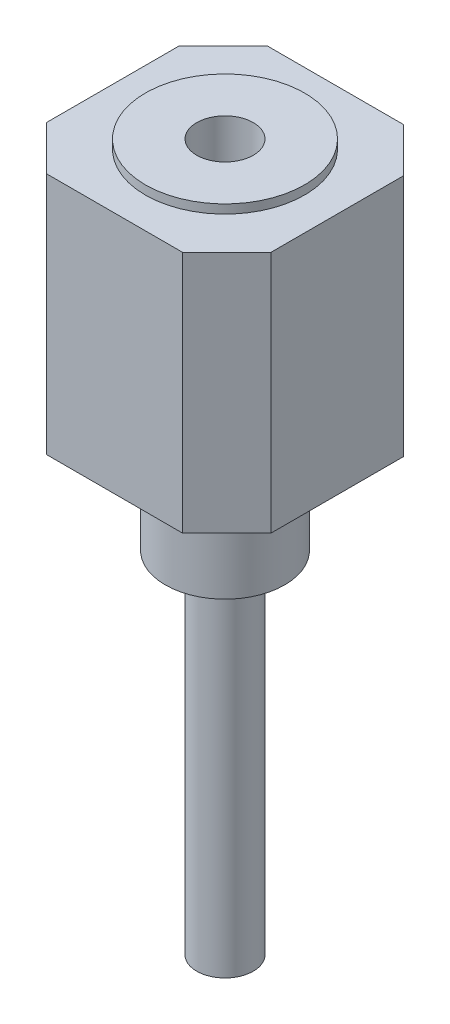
ISO-10303-21;
HEADER;
FILE_DESCRIPTION(('STEP AP214'),'2;1');
FILE_NAME('part.step','',(''),(''),'','','');
FILE_SCHEMA(('AUTOMOTIVE_DESIGN { 1 0 10303 214 1 1 1 1 }'));
ENDSEC;
DATA;
#1=APPLICATION_CONTEXT('core data for automotive mechanical design processes');
#2=APPLICATION_PROTOCOL_DEFINITION('international standard','automotive_design',2000,#1);
#3=PRODUCT_CONTEXT('',#1,'mechanical');
#4=PRODUCT('Part','Part','',(#3));
#5=PRODUCT_RELATED_PRODUCT_CATEGORY('part','',(#4));
#6=PRODUCT_DEFINITION_FORMATION('','',#4);
#7=PRODUCT_DEFINITION_CONTEXT('part definition',#1,'design');
#8=PRODUCT_DEFINITION('design','',#6,#7);
#9=PRODUCT_DEFINITION_SHAPE('','',#8);
#10=(LENGTH_UNIT() NAMED_UNIT(*) SI_UNIT(.MILLI.,.METRE.));
#11=(NAMED_UNIT(*) PLANE_ANGLE_UNIT() SI_UNIT($,.RADIAN.));
#12=(NAMED_UNIT(*) SI_UNIT($,.STERADIAN.) SOLID_ANGLE_UNIT());
#13=UNCERTAINTY_MEASURE_WITH_UNIT(LENGTH_MEASURE(1.E-05),#10,'distance_accuracy_value','');
#14=(GEOMETRIC_REPRESENTATION_CONTEXT(3) GLOBAL_UNCERTAINTY_ASSIGNED_CONTEXT((#13)) GLOBAL_UNIT_ASSIGNED_CONTEXT((#10,
#11,#12)) REPRESENTATION_CONTEXT('',''));
#15=CARTESIAN_POINT('',(0.,0.,0.));
#16=DIRECTION('',(0.,0.,1.));
#17=DIRECTION('',(1.,0.,0.));
#18=AXIS2_PLACEMENT_3D('',#15,#16,#17);
#19=CARTESIAN_POINT('',(0.,-1.18,0.));
#20=DIRECTION('',(0.,-1.,0.));
#21=DIRECTION('',(0.,0.,-1.));
#22=AXIS2_PLACEMENT_3D('',#19,#20,#21);
#23=PLANE('',#22);
#24=CARTESIAN_POINT('',(0.,-1.18,0.));
#25=DIRECTION('',(0.,-1.,0.));
#26=DIRECTION('',(0.,0.,-1.));
#27=AXIS2_PLACEMENT_3D('',#24,#25,#26);
#28=CIRCLE('',#27,0.675);
#29=CARTESIAN_POINT('',(0.,-1.18,-0.675));
#30=VERTEX_POINT('',#29);
#31=EDGE_CURVE('E188',#30,#30,#28,.T.);
#32=ORIENTED_EDGE('',*,*,#31,.T.);
#33=EDGE_LOOP('',(#32));
#34=FACE_BOUND('',#33,.T.);
#35=CARTESIAN_POINT('',(0.,-1.18,0.));
#36=DIRECTION('',(0.,-1.,0.));
#37=DIRECTION('',(0.,0.,-1.));
#38=AXIS2_PLACEMENT_3D('',#35,#36,#37);
#39=CIRCLE('',#38,0.32);
#40=CARTESIAN_POINT('',(0.,-1.18,-0.32));
#41=VERTEX_POINT('',#40);
#42=EDGE_CURVE('E194',#41,#41,#39,.T.);
#43=ORIENTED_EDGE('',*,*,#42,.F.);
#44=EDGE_LOOP('',(#43));
#45=FACE_BOUND('',#44,.T.);
#46=ADVANCED_FACE('F33',(#34,#45),#23,.T.);
#47=CARTESIAN_POINT('',(-1.27000000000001,0.,1.25));
#48=DIRECTION('',(0.,1.,0.));
#49=DIRECTION('',(0.,0.,1.));
#50=AXIS2_PLACEMENT_3D('',#47,#48,#49);
#51=PLANE('',#50);
#52=DIRECTION('',(0.,0.,1.));
#53=VECTOR('',#52,1.);
#54=CARTESIAN_POINT('',(-1.27,0.,-0.75));
#55=LINE('',#54,#53);
#56=CARTESIAN_POINT('',(-1.27,0.,-0.75));
#57=VERTEX_POINT('',#56);
#58=CARTESIAN_POINT('',(-1.27000000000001,0.,0.75));
#59=VERTEX_POINT('',#58);
#60=EDGE_CURVE('E132',#57,#59,#55,.T.);
#61=ORIENTED_EDGE('',*,*,#60,.F.);
#62=DIRECTION('',(-0.707106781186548,0.,0.707106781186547));
#63=VECTOR('',#62,1.);
#64=CARTESIAN_POINT('',(-1.27,0.,-0.75));
#65=LINE('',#64,#63);
#66=CARTESIAN_POINT('',(-0.77,0.,-1.25));
#67=VERTEX_POINT('',#66);
#68=EDGE_CURVE('E85',#67,#57,#65,.T.);
#69=ORIENTED_EDGE('',*,*,#68,.F.);
#70=DIRECTION('',(-1.,0.,0.));
#71=VECTOR('',#70,1.);
#72=CARTESIAN_POINT('',(-0.77,0.,-1.25));
#73=LINE('',#72,#71);
#74=CARTESIAN_POINT('',(0.77,0.,-1.24999999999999));
#75=VERTEX_POINT('',#74);
#76=EDGE_CURVE('E79',#75,#67,#73,.T.);
#77=ORIENTED_EDGE('',*,*,#76,.F.);
#78=DIRECTION('',(-0.707106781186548,0.,-0.707106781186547));
#79=VECTOR('',#78,1.);
#80=CARTESIAN_POINT('',(1.27,0.,-0.749999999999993));
#81=LINE('',#80,#79);
#82=CARTESIAN_POINT('',(1.27,0.,-0.749999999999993));
#83=VERTEX_POINT('',#82);
#84=EDGE_CURVE('E122',#83,#75,#81,.T.);
#85=ORIENTED_EDGE('',*,*,#84,.F.);
#86=DIRECTION('',(0.,0.,-1.));
#87=VECTOR('',#86,1.);
#88=CARTESIAN_POINT('',(1.26999999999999,0.,0.749999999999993));
#89=LINE('',#88,#87);
#90=CARTESIAN_POINT('',(1.26999999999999,0.,0.749999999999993));
#91=VERTEX_POINT('',#90);
#92=EDGE_CURVE('E142',#91,#83,#89,.T.);
#93=ORIENTED_EDGE('',*,*,#92,.F.);
#94=DIRECTION('',(0.707106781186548,0.,-0.707106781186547));
#95=VECTOR('',#94,1.);
#96=CARTESIAN_POINT('',(1.26999999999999,0.,0.749999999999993));
#97=LINE('',#96,#95);
#98=CARTESIAN_POINT('',(0.769999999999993,0.,1.24999999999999));
#99=VERTEX_POINT('',#98);
#100=EDGE_CURVE('E140',#99,#91,#97,.T.);
#101=ORIENTED_EDGE('',*,*,#100,.F.);
#102=DIRECTION('',(1.,0.,0.));
#103=VECTOR('',#102,1.);
#104=CARTESIAN_POINT('',(-0.770000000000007,0.,1.25));
#105=LINE('',#104,#103);
#106=CARTESIAN_POINT('',(-0.770000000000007,0.,1.25));
#107=VERTEX_POINT('',#106);
#108=EDGE_CURVE('E138',#107,#99,#105,.T.);
#109=ORIENTED_EDGE('',*,*,#108,.F.);
#110=DIRECTION('',(0.707106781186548,0.,0.707106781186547));
#111=VECTOR('',#110,1.);
#112=CARTESIAN_POINT('',(-1.27000000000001,0.,0.75));
#113=LINE('',#112,#111);
#114=EDGE_CURVE('E135',#59,#107,#113,.T.);
#115=ORIENTED_EDGE('',*,*,#114,.F.);
#116=EDGE_LOOP('',(#61,#69,#77,#85,#93,#101,#109,#115));
#117=FACE_BOUND('',#116,.T.);
#118=CARTESIAN_POINT('',(0.,0.,0.));
#119=DIRECTION('',(0.,1.,0.));
#120=DIRECTION('',(0.,0.,1.));
#121=AXIS2_PLACEMENT_3D('',#118,#119,#120);
#122=CIRCLE('',#121,0.675);
#123=CARTESIAN_POINT('',(0.,0.,0.675));
#124=VERTEX_POINT('',#123);
#125=EDGE_CURVE('E11',#124,#124,#122,.F.);
#126=ORIENTED_EDGE('',*,*,#125,.F.);
#127=EDGE_LOOP('',(#126));
#128=FACE_BOUND('',#127,.T.);
#129=ADVANCED_FACE('F165',(#117,#128),#51,.F.);
#130=CARTESIAN_POINT('',(-1.27000000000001,2.75,1.25));
#131=DIRECTION('',(0.,1.,0.));
#132=DIRECTION('',(0.,0.,1.));
#133=AXIS2_PLACEMENT_3D('',#130,#131,#132);
#134=PLANE('',#133);
#135=DIRECTION('',(0.,0.,1.));
#136=VECTOR('',#135,1.);
#137=CARTESIAN_POINT('',(-1.27,2.75,-0.75));
#138=LINE('',#137,#136);
#139=CARTESIAN_POINT('',(-1.27,2.75,-0.75));
#140=VERTEX_POINT('',#139);
#141=CARTESIAN_POINT('',(-1.27000000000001,2.75,0.75));
#142=VERTEX_POINT('',#141);
#143=EDGE_CURVE('E147',#140,#142,#138,.T.);
#144=ORIENTED_EDGE('',*,*,#143,.T.);
#145=DIRECTION('',(0.707106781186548,0.,0.707106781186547));
#146=VECTOR('',#145,1.);
#147=CARTESIAN_POINT('',(-1.27000000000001,2.75,0.75));
#148=LINE('',#147,#146);
#149=CARTESIAN_POINT('',(-0.770000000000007,2.75,1.25));
#150=VERTEX_POINT('',#149);
#151=EDGE_CURVE('E94',#142,#150,#148,.T.);
#152=ORIENTED_EDGE('',*,*,#151,.T.);
#153=DIRECTION('',(1.,0.,0.));
#154=VECTOR('',#153,1.);
#155=CARTESIAN_POINT('',(-0.770000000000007,2.75,1.25));
#156=LINE('',#155,#154);
#157=CARTESIAN_POINT('',(0.769999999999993,2.75,1.24999999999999));
#158=VERTEX_POINT('',#157);
#159=EDGE_CURVE('E179',#150,#158,#156,.T.);
#160=ORIENTED_EDGE('',*,*,#159,.T.);
#161=DIRECTION('',(0.707106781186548,0.,-0.707106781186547));
#162=VECTOR('',#161,1.);
#163=CARTESIAN_POINT('',(1.26999999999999,2.75,0.749999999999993));
#164=LINE('',#163,#162);
#165=CARTESIAN_POINT('',(1.26999999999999,2.75,0.749999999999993));
#166=VERTEX_POINT('',#165);
#167=EDGE_CURVE('E178',#158,#166,#164,.T.);
#168=ORIENTED_EDGE('',*,*,#167,.T.);
#169=DIRECTION('',(0.,0.,-1.));
#170=VECTOR('',#169,1.);
#171=CARTESIAN_POINT('',(1.26999999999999,2.75,0.749999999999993));
#172=LINE('',#171,#170);
#173=CARTESIAN_POINT('',(1.27,2.75,-0.749999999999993));
#174=VERTEX_POINT('',#173);
#175=EDGE_CURVE('E114',#166,#174,#172,.T.);
#176=ORIENTED_EDGE('',*,*,#175,.T.);
#177=DIRECTION('',(-0.707106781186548,0.,-0.707106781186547));
#178=VECTOR('',#177,1.);
#179=CARTESIAN_POINT('',(1.27,2.75,-0.749999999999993));
#180=LINE('',#179,#178);
#181=CARTESIAN_POINT('',(0.77,2.75,-1.24999999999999));
#182=VERTEX_POINT('',#181);
#183=EDGE_CURVE('E107',#174,#182,#180,.T.);
#184=ORIENTED_EDGE('',*,*,#183,.T.);
#185=DIRECTION('',(-1.,0.,0.));
#186=VECTOR('',#185,1.);
#187=CARTESIAN_POINT('',(-0.77,2.75,-1.25));
#188=LINE('',#187,#186);
#189=CARTESIAN_POINT('',(-0.77,2.75,-1.25));
#190=VERTEX_POINT('',#189);
#191=EDGE_CURVE('E112',#182,#190,#188,.T.);
#192=ORIENTED_EDGE('',*,*,#191,.T.);
#193=DIRECTION('',(-0.707106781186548,0.,0.707106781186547));
#194=VECTOR('',#193,1.);
#195=CARTESIAN_POINT('',(-1.27,2.75,-0.75));
#196=LINE('',#195,#194);
#197=EDGE_CURVE('E50',#190,#140,#196,.T.);
#198=ORIENTED_EDGE('',*,*,#197,.T.);
#199=EDGE_LOOP('',(#144,#152,#160,#168,#176,#184,#192,#198));
#200=FACE_BOUND('',#199,.T.);
#201=CARTESIAN_POINT('',(0.,2.75,0.));
#202=DIRECTION('',(0.,1.,0.));
#203=DIRECTION('',(0.,0.,1.));
#204=AXIS2_PLACEMENT_3D('',#201,#202,#203);
#205=CIRCLE('',#204,0.9);
#206=CARTESIAN_POINT('',(0.,2.75,0.9));
#207=VERTEX_POINT('',#206);
#208=EDGE_CURVE('E185',#207,#207,#205,.T.);
#209=ORIENTED_EDGE('',*,*,#208,.F.);
#210=EDGE_LOOP('',(#209));
#211=FACE_BOUND('',#210,.T.);
#212=ADVANCED_FACE('F109',(#200,#211),#134,.T.);
#213=CARTESIAN_POINT('',(-1.27,2.75,-0.75));
#214=DIRECTION('',(1.,0.,0.));
#215=DIRECTION('',(0.,0.,-1.));
#216=AXIS2_PLACEMENT_3D('',#213,#214,#215);
#217=PLANE('',#216);
#218=ORIENTED_EDGE('',*,*,#60,.T.);
#219=DIRECTION('',(0.,-1.,0.));
#220=VECTOR('',#219,1.);
#221=CARTESIAN_POINT('',(-1.27000000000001,2.75,0.75));
#222=LINE('',#221,#220);
#223=EDGE_CURVE('E42',#142,#59,#222,.T.);
#224=ORIENTED_EDGE('',*,*,#223,.F.);
#225=ORIENTED_EDGE('',*,*,#143,.F.);
#226=DIRECTION('',(0.,-1.,0.));
#227=VECTOR('',#226,1.);
#228=CARTESIAN_POINT('',(-1.27,2.75,-0.75));
#229=LINE('',#228,#227);
#230=EDGE_CURVE('E128',#140,#57,#229,.T.);
#231=ORIENTED_EDGE('',*,*,#230,.T.);
#232=EDGE_LOOP('',(#218,#224,#225,#231));
#233=FACE_BOUND('',#232,.T.);
#234=ADVANCED_FACE('F35',(#233),#217,.F.);
#235=CARTESIAN_POINT('',(-1.27000000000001,2.75,0.75));
#236=DIRECTION('',(0.707106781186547,0.,-0.707106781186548));
#237=DIRECTION('',(-0.707106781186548,0.,-0.707106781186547));
#238=AXIS2_PLACEMENT_3D('',#235,#236,#237);
#239=PLANE('',#238);
#240=ORIENTED_EDGE('',*,*,#114,.T.);
#241=DIRECTION('',(0.,-1.,0.));
#242=VECTOR('',#241,1.);
#243=CARTESIAN_POINT('',(-0.770000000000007,2.75,1.25));
#244=LINE('',#243,#242);
#245=EDGE_CURVE('E157',#150,#107,#244,.T.);
#246=ORIENTED_EDGE('',*,*,#245,.F.);
#247=ORIENTED_EDGE('',*,*,#151,.F.);
#248=ORIENTED_EDGE('',*,*,#223,.T.);
#249=EDGE_LOOP('',(#240,#246,#247,#248));
#250=FACE_BOUND('',#249,.T.);
#251=ADVANCED_FACE('F160',(#250),#239,.F.);
#252=CARTESIAN_POINT('',(-0.770000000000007,2.75,1.25));
#253=DIRECTION('',(0.,0.,-1.));
#254=DIRECTION('',(-1.,0.,0.));
#255=AXIS2_PLACEMENT_3D('',#252,#253,#254);
#256=PLANE('',#255);
#257=ORIENTED_EDGE('',*,*,#108,.T.);
#258=DIRECTION('',(0.,-1.,0.));
#259=VECTOR('',#258,1.);
#260=CARTESIAN_POINT('',(0.769999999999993,2.75,1.24999999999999));
#261=LINE('',#260,#259);
#262=EDGE_CURVE('E154',#158,#99,#261,.T.);
#263=ORIENTED_EDGE('',*,*,#262,.F.);
#264=ORIENTED_EDGE('',*,*,#159,.F.);
#265=ORIENTED_EDGE('',*,*,#245,.T.);
#266=EDGE_LOOP('',(#257,#263,#264,#265));
#267=FACE_BOUND('',#266,.T.);
#268=ADVANCED_FACE('F172',(#267),#256,.F.);
#269=CARTESIAN_POINT('',(1.26999999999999,2.75,0.749999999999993));
#270=DIRECTION('',(-0.707106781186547,0.,-0.707106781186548));
#271=DIRECTION('',(-0.707106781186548,0.,0.707106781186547));
#272=AXIS2_PLACEMENT_3D('',#269,#270,#271);
#273=PLANE('',#272);
#274=ORIENTED_EDGE('',*,*,#100,.T.);
#275=DIRECTION('',(0.,-1.,0.));
#276=VECTOR('',#275,1.);
#277=CARTESIAN_POINT('',(1.26999999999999,2.75,0.749999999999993));
#278=LINE('',#277,#276);
#279=EDGE_CURVE('E151',#166,#91,#278,.T.);
#280=ORIENTED_EDGE('',*,*,#279,.F.);
#281=ORIENTED_EDGE('',*,*,#167,.F.);
#282=ORIENTED_EDGE('',*,*,#262,.T.);
#283=EDGE_LOOP('',(#274,#280,#281,#282));
#284=FACE_BOUND('',#283,.T.);
#285=ADVANCED_FACE('F176',(#284),#273,.F.);
#286=CARTESIAN_POINT('',(1.26999999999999,2.75,0.749999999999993));
#287=DIRECTION('',(-1.,0.,0.));
#288=DIRECTION('',(0.,0.,1.));
#289=AXIS2_PLACEMENT_3D('',#286,#287,#288);
#290=PLANE('',#289);
#291=ORIENTED_EDGE('',*,*,#92,.T.);
#292=DIRECTION('',(0.,-1.,0.));
#293=VECTOR('',#292,1.);
#294=CARTESIAN_POINT('',(1.27,2.75,-0.749999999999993));
#295=LINE('',#294,#293);
#296=EDGE_CURVE('E123',#174,#83,#295,.T.);
#297=ORIENTED_EDGE('',*,*,#296,.F.);
#298=ORIENTED_EDGE('',*,*,#175,.F.);
#299=ORIENTED_EDGE('',*,*,#279,.T.);
#300=EDGE_LOOP('',(#291,#297,#298,#299));
#301=FACE_BOUND('',#300,.T.);
#302=ADVANCED_FACE('F334',(#301),#290,.F.);
#303=CARTESIAN_POINT('',(1.27,2.75,-0.749999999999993));
#304=DIRECTION('',(-0.707106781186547,0.,0.707106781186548));
#305=DIRECTION('',(0.707106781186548,0.,0.707106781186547));
#306=AXIS2_PLACEMENT_3D('',#303,#304,#305);
#307=PLANE('',#306);
#308=ORIENTED_EDGE('',*,*,#84,.T.);
#309=DIRECTION('',(0.,-1.,0.));
#310=VECTOR('',#309,1.);
#311=CARTESIAN_POINT('',(0.77,2.75,-1.24999999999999));
#312=LINE('',#311,#310);
#313=EDGE_CURVE('E119',#182,#75,#312,.T.);
#314=ORIENTED_EDGE('',*,*,#313,.F.);
#315=ORIENTED_EDGE('',*,*,#183,.F.);
#316=ORIENTED_EDGE('',*,*,#296,.T.);
#317=EDGE_LOOP('',(#308,#314,#315,#316));
#318=FACE_BOUND('',#317,.T.);
#319=ADVANCED_FACE('F120',(#318),#307,.F.);
#320=CARTESIAN_POINT('',(-0.77,2.75,-1.25));
#321=DIRECTION('',(0.,0.,1.));
#322=DIRECTION('',(1.,0.,0.));
#323=AXIS2_PLACEMENT_3D('',#320,#321,#322);
#324=PLANE('',#323);
#325=ORIENTED_EDGE('',*,*,#76,.T.);
#326=DIRECTION('',(0.,-1.,0.));
#327=VECTOR('',#326,1.);
#328=CARTESIAN_POINT('',(-0.77,2.75,-1.25));
#329=LINE('',#328,#327);
#330=EDGE_CURVE('E124',#190,#67,#329,.T.);
#331=ORIENTED_EDGE('',*,*,#330,.F.);
#332=ORIENTED_EDGE('',*,*,#191,.F.);
#333=ORIENTED_EDGE('',*,*,#313,.T.);
#334=EDGE_LOOP('',(#325,#331,#332,#333));
#335=FACE_BOUND('',#334,.T.);
#336=ADVANCED_FACE('F126',(#335),#324,.F.);
#337=CARTESIAN_POINT('',(-1.27,2.75,-0.75));
#338=DIRECTION('',(0.707106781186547,0.,0.707106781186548));
#339=DIRECTION('',(0.707106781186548,0.,-0.707106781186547));
#340=AXIS2_PLACEMENT_3D('',#337,#338,#339);
#341=PLANE('',#340);
#342=ORIENTED_EDGE('',*,*,#68,.T.);
#343=ORIENTED_EDGE('',*,*,#230,.F.);
#344=ORIENTED_EDGE('',*,*,#197,.F.);
#345=ORIENTED_EDGE('',*,*,#330,.T.);
#346=EDGE_LOOP('',(#342,#343,#344,#345));
#347=FACE_BOUND('',#346,.T.);
#348=ADVANCED_FACE('F225',(#347),#341,.F.);
#349=CARTESIAN_POINT('',(0.,2.85,0.));
#350=DIRECTION('',(0.,-1.,0.));
#351=DIRECTION('',(0.,0.,-1.));
#352=AXIS2_PLACEMENT_3D('',#349,#350,#351);
#353=CYLINDRICAL_SURFACE('',#352,0.9);
#354=CARTESIAN_POINT('',(0.,2.85,0.));
#355=DIRECTION('',(0.,1.,0.));
#356=DIRECTION('',(0.,0.,1.));
#357=AXIS2_PLACEMENT_3D('',#354,#355,#356);
#358=CIRCLE('',#357,0.9);
#359=CARTESIAN_POINT('',(0.,2.85,0.9));
#360=VERTEX_POINT('',#359);
#361=EDGE_CURVE('E136',#360,#360,#358,.T.);
#362=ORIENTED_EDGE('',*,*,#361,.F.);
#363=EDGE_LOOP('',(#362));
#364=FACE_BOUND('',#363,.T.);
#365=ORIENTED_EDGE('',*,*,#208,.T.);
#366=EDGE_LOOP('',(#365));
#367=FACE_BOUND('',#366,.T.);
#368=ADVANCED_FACE('F219',(#364,#367),#353,.T.);
#369=CARTESIAN_POINT('',(0.,2.85,0.));
#370=DIRECTION('',(0.,1.,0.));
#371=DIRECTION('',(0.,0.,1.));
#372=AXIS2_PLACEMENT_3D('',#369,#370,#371);
#373=PLANE('',#372);
#374=CARTESIAN_POINT('',(0.,2.85,0.));
#375=DIRECTION('',(0.,1.,0.));
#376=DIRECTION('',(0.,0.,1.));
#377=AXIS2_PLACEMENT_3D('',#374,#375,#376);
#378=CIRCLE('',#377,0.32);
#379=CARTESIAN_POINT('',(0.,2.85,0.32));
#380=VERTEX_POINT('',#379);
#381=EDGE_CURVE('E200',#380,#380,#378,.T.);
#382=ORIENTED_EDGE('',*,*,#381,.F.);
#383=EDGE_LOOP('',(#382));
#384=FACE_BOUND('',#383,.T.);
#385=ORIENTED_EDGE('',*,*,#361,.T.);
#386=EDGE_LOOP('',(#385));
#387=FACE_BOUND('',#386,.T.);
#388=ADVANCED_FACE('F215',(#384,#387),#373,.T.);
#389=CARTESIAN_POINT('',(0.,-1.18,0.));
#390=DIRECTION('',(0.,1.,0.));
#391=DIRECTION('',(0.,0.,1.));
#392=AXIS2_PLACEMENT_3D('',#389,#390,#391);
#393=CYLINDRICAL_SURFACE('',#392,0.675);
#394=ORIENTED_EDGE('',*,*,#31,.F.);
#395=EDGE_LOOP('',(#394));
#396=FACE_BOUND('',#395,.T.);
#397=ORIENTED_EDGE('',*,*,#125,.T.);
#398=EDGE_LOOP('',(#397));
#399=FACE_BOUND('',#398,.T.);
#400=ADVANCED_FACE('F218',(#396,#399),#393,.T.);
#401=CARTESIAN_POINT('',(0.,-5.14,0.));
#402=DIRECTION('',(0.,1.,0.));
#403=DIRECTION('',(0.,0.,1.));
#404=AXIS2_PLACEMENT_3D('',#401,#402,#403);
#405=CYLINDRICAL_SURFACE('',#404,0.32);
#406=CARTESIAN_POINT('',(0.,-5.14,0.));
#407=DIRECTION('',(0.,-1.,0.));
#408=DIRECTION('',(0.,0.,-1.));
#409=AXIS2_PLACEMENT_3D('',#406,#407,#408);
#410=CIRCLE('',#409,0.32);
#411=CARTESIAN_POINT('',(0.,-5.14,-0.32));
#412=VERTEX_POINT('',#411);
#413=EDGE_CURVE('E193',#412,#412,#410,.T.);
#414=ORIENTED_EDGE('',*,*,#413,.F.);
#415=EDGE_LOOP('',(#414));
#416=FACE_BOUND('',#415,.T.);
#417=ORIENTED_EDGE('',*,*,#42,.T.);
#418=EDGE_LOOP('',(#417));
#419=FACE_BOUND('',#418,.T.);
#420=ADVANCED_FACE('F243',(#416,#419),#405,.T.);
#421=CARTESIAN_POINT('',(0.,-5.14,0.));
#422=DIRECTION('',(0.,-1.,0.));
#423=DIRECTION('',(0.,0.,-1.));
#424=AXIS2_PLACEMENT_3D('',#421,#422,#423);
#425=PLANE('',#424);
#426=ORIENTED_EDGE('',*,*,#413,.T.);
#427=EDGE_LOOP('',(#426));
#428=FACE_BOUND('',#427,.T.);
#429=ADVANCED_FACE('F211',(#428),#425,.T.);
#430=CARTESIAN_POINT('',(0.,-0.95,0.));
#431=DIRECTION('',(0.,1.,0.));
#432=DIRECTION('',(0.,0.,1.));
#433=AXIS2_PLACEMENT_3D('',#430,#431,#432);
#434=CYLINDRICAL_SURFACE('',#433,0.32);
#435=CARTESIAN_POINT('',(0.,-0.95,0.));
#436=DIRECTION('',(0.,1.,0.));
#437=DIRECTION('',(0.,0.,1.));
#438=AXIS2_PLACEMENT_3D('',#435,#436,#437);
#439=CIRCLE('',#438,0.32);
#440=CARTESIAN_POINT('',(0.,-0.95,0.32));
#441=VERTEX_POINT('',#440);
#442=EDGE_CURVE('E197',#441,#441,#439,.T.);
#443=ORIENTED_EDGE('',*,*,#442,.F.);
#444=EDGE_LOOP('',(#443));
#445=FACE_BOUND('',#444,.T.);
#446=ORIENTED_EDGE('',*,*,#381,.T.);
#447=EDGE_LOOP('',(#446));
#448=FACE_BOUND('',#447,.T.);
#449=ADVANCED_FACE('F208',(#445,#448),#434,.F.);
#450=CARTESIAN_POINT('',(0.,-0.95,0.));
#451=DIRECTION('',(0.,1.,0.));
#452=DIRECTION('',(0.,0.,1.));
#453=AXIS2_PLACEMENT_3D('',#450,#451,#452);
#454=PLANE('',#453);
#455=ORIENTED_EDGE('',*,*,#442,.T.);
#456=EDGE_LOOP('',(#455));
#457=FACE_BOUND('',#456,.T.);
#458=ADVANCED_FACE('F206',(#457),#454,.T.);
#459=CLOSED_SHELL('',(#46,#129,#212,#234,#251,#268,#285,#302,#319,#336,#348,#368,#388,#400,#420,
#429,#449,#458));
#460=MANIFOLD_SOLID_BREP('B2',#459);
#461=ADVANCED_BREP_SHAPE_REPRESENTATION('',(#18,#460),#14);
#462=SHAPE_DEFINITION_REPRESENTATION(#9,#461);
ENDSEC;
END-ISO-10303-21;
